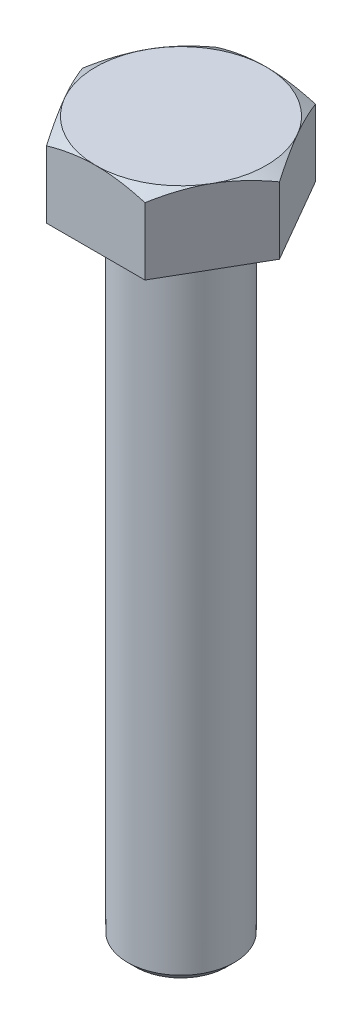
ISO-10303-21;
HEADER;
FILE_DESCRIPTION(('STEP AP214'),'2;1');
FILE_NAME('part.step','',(''),(''),'','','');
FILE_SCHEMA(('AUTOMOTIVE_DESIGN { 1 0 10303 214 1 1 1 1 }'));
ENDSEC;
DATA;
#1=APPLICATION_CONTEXT('core data for automotive mechanical design processes');
#2=APPLICATION_PROTOCOL_DEFINITION('international standard','automotive_design',2000,#1);
#3=PRODUCT_CONTEXT('',#1,'mechanical');
#4=PRODUCT('Part','Part','',(#3));
#5=PRODUCT_RELATED_PRODUCT_CATEGORY('part','',(#4));
#6=PRODUCT_DEFINITION_FORMATION('','',#4);
#7=PRODUCT_DEFINITION_CONTEXT('part definition',#1,'design');
#8=PRODUCT_DEFINITION('design','',#6,#7);
#9=PRODUCT_DEFINITION_SHAPE('','',#8);
#10=(LENGTH_UNIT() NAMED_UNIT(*) SI_UNIT(.MILLI.,.METRE.));
#11=(NAMED_UNIT(*) PLANE_ANGLE_UNIT() SI_UNIT($,.RADIAN.));
#12=(NAMED_UNIT(*) SI_UNIT($,.STERADIAN.) SOLID_ANGLE_UNIT());
#13=UNCERTAINTY_MEASURE_WITH_UNIT(LENGTH_MEASURE(1.E-05),#10,'distance_accuracy_value','');
#14=(GEOMETRIC_REPRESENTATION_CONTEXT(3) GLOBAL_UNCERTAINTY_ASSIGNED_CONTEXT((#13)) GLOBAL_UNIT_ASSIGNED_CONTEXT((#10,
#11,#12)) REPRESENTATION_CONTEXT('',''));
#15=CARTESIAN_POINT('',(0.,0.,0.));
#16=DIRECTION('',(0.,0.,1.));
#17=DIRECTION('',(1.,0.,0.));
#18=AXIS2_PLACEMENT_3D('',#15,#16,#17);
#19=CARTESIAN_POINT('',(0.,-60.,0.));
#20=DIRECTION('',(0.,1.,0.));
#21=DIRECTION('',(0.,0.,1.));
#22=AXIS2_PLACEMENT_3D('',#19,#20,#21);
#23=CYLINDRICAL_SURFACE('',#22,5.);
#24=CARTESIAN_POINT('',(0.,0.,0.));
#25=DIRECTION('',(0.,1.,0.));
#26=DIRECTION('',(0.,0.,1.));
#27=AXIS2_PLACEMENT_3D('',#24,#25,#26);
#28=CIRCLE('',#27,5.);
#29=CARTESIAN_POINT('',(0.,0.,5.));
#30=VERTEX_POINT('',#29);
#31=EDGE_CURVE('E260',#30,#30,#28,.F.);
#32=ORIENTED_EDGE('',*,*,#31,.T.);
#33=EDGE_LOOP('',(#32));
#34=FACE_BOUND('',#33,.T.);
#35=CARTESIAN_POINT('',(0.,-59.25,0.));
#36=DIRECTION('',(0.,1.,0.));
#37=DIRECTION('',(0.,0.,1.));
#38=AXIS2_PLACEMENT_3D('',#35,#36,#37);
#39=CIRCLE('',#38,5.);
#40=CARTESIAN_POINT('',(0.,-59.25,5.));
#41=VERTEX_POINT('',#40);
#42=EDGE_CURVE('E140',#41,#41,#39,.F.);
#43=ORIENTED_EDGE('',*,*,#42,.F.);
#44=EDGE_LOOP('',(#43));
#45=FACE_BOUND('',#44,.T.);
#46=ADVANCED_FACE('F47',(#34,#45),#23,.T.);
#47=CARTESIAN_POINT('',(4.61880215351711,7.,7.99999999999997));
#48=DIRECTION('',(-0.866025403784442,0.,-0.499999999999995));
#49=DIRECTION('',(-0.499999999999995,0.,0.866025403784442));
#50=AXIS2_PLACEMENT_3D('',#47,#48,#49);
#51=PLANE('',#50);
#52=CARTESIAN_POINT('',(4.61868668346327,6.28540215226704,8.00019999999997));
#53=CARTESIAN_POINT('',(4.720213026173,6.34400928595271,7.82435121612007));
#54=CARTESIAN_POINT('',(4.82211789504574,6.39995659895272,7.64784680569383));
#55=CARTESIAN_POINT('',(5.02675523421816,6.50579899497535,7.2934045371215));
#56=CARTESIAN_POINT('',(5.1294880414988,6.55569146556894,7.11546609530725));
#57=CARTESIAN_POINT('',(5.43933133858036,6.69530720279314,6.57880176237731));
#58=CARTESIAN_POINT('',(5.64766491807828,6.77471882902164,6.21795741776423));
#59=CARTESIAN_POINT('',(5.95943209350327,6.86783835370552,5.6779608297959));
#60=CARTESIAN_POINT('',(6.06193429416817,6.89436541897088,5.50042181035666));
#61=CARTESIAN_POINT('',(6.26740224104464,6.93884682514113,5.14454088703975));
#62=CARTESIAN_POINT('',(6.37036794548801,6.95680192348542,4.96619905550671));
#63=CARTESIAN_POINT('',(6.57647664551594,6.98368435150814,4.60920831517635));
#64=CARTESIAN_POINT('',(6.67961930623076,6.99262192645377,4.43055998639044));
#65=CARTESIAN_POINT('',(6.88599991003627,7.00127769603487,4.07309829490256));
#66=CARTESIAN_POINT('',(6.98923785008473,7.00099617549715,3.89428493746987));
#67=CARTESIAN_POINT('',(7.18224506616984,6.99185497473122,3.55998663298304));
#68=CARTESIAN_POINT('',(7.27202796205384,6.98411039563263,3.40447809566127));
#69=CARTESIAN_POINT('',(7.45138347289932,6.96179886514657,3.09382523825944));
#70=CARTESIAN_POINT('',(7.54095607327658,6.94723145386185,2.93868094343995));
#71=CARTESIAN_POINT('',(7.80932710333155,6.89363930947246,2.47384868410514));
#72=CARTESIAN_POINT('',(7.98765049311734,6.84473135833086,2.16498351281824));
#73=CARTESIAN_POINT('',(8.34618890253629,6.72246059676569,1.54397677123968));
#74=CARTESIAN_POINT('',(8.52635816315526,6.64857947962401,1.2319144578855));
#75=CARTESIAN_POINT('',(8.88400987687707,6.48089985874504,0.612443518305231));
#76=CARTESIAN_POINT('',(9.0614969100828,6.38714073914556,0.305026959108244));
#77=CARTESIAN_POINT('',(9.23771977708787,6.28540215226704,-0.000200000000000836));
#78=B_SPLINE_CURVE_WITH_KNOTS('',3,(#52,#53,#54,#55,#56,#57,#58,#59,#60,#61,#62,#63,#64,#65,#66,
#67,#68,#69,#70,#71,#72,#73,#74,#75,#76,#77),.UNSPECIFIED.,.F.,.F.,(4,2,2,2,2,2,2,2,2,2,2,2,4),
(0.,0.633973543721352,1.26821965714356,2.53934712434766,3.1593434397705,3.77928496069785,
4.39852133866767,5.01773858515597,5.55680239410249,6.09590254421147,7.17487077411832,
8.27776850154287,9.37850115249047),.UNSPECIFIED.);
#79=CARTESIAN_POINT('',(4.61880215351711,6.28546882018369,7.99999999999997));
#80=VERTEX_POINT('',#79);
#81=CARTESIAN_POINT('',(6.92820323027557,7.,3.99999999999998));
#82=VERTEX_POINT('',#81);
#83=EDGE_CURVE('E122',#80,#82,#78,.T.);
#84=ORIENTED_EDGE('',*,*,#83,.F.);
#85=DIRECTION('',(0.,-1.,0.));
#86=VECTOR('',#85,1.);
#87=CARTESIAN_POINT('',(4.61880215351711,7.,7.99999999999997));
#88=LINE('',#87,#86);
#89=CARTESIAN_POINT('',(4.61880215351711,0.,7.99999999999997));
#90=VERTEX_POINT('',#89);
#91=EDGE_CURVE('E71',#80,#90,#88,.T.);
#92=ORIENTED_EDGE('',*,*,#91,.T.);
#93=DIRECTION('',(0.499999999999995,0.,-0.866025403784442));
#94=VECTOR('',#93,1.);
#95=CARTESIAN_POINT('',(4.61880215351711,0.,7.99999999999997));
#96=LINE('',#95,#94);
#97=CARTESIAN_POINT('',(9.23760430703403,0.,0.));
#98=VERTEX_POINT('',#97);
#99=EDGE_CURVE('E129',#90,#98,#96,.T.);
#100=ORIENTED_EDGE('',*,*,#99,.T.);
#101=DIRECTION('',(0.,-1.,0.));
#102=VECTOR('',#101,1.);
#103=CARTESIAN_POINT('',(9.23760430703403,7.,0.));
#104=LINE('',#103,#102);
#105=CARTESIAN_POINT('',(9.23760430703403,6.28546882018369,0.));
#106=VERTEX_POINT('',#105);
#107=EDGE_CURVE('E143',#106,#98,#104,.T.);
#108=ORIENTED_EDGE('',*,*,#107,.F.);
#109=EDGE_CURVE('E130',#82,#106,#78,.T.);
#110=ORIENTED_EDGE('',*,*,#109,.F.);
#111=EDGE_LOOP('',(#84,#92,#100,#108,#110));
#112=FACE_BOUND('',#111,.T.);
#113=ADVANCED_FACE('F49',(#112),#51,.F.);
#114=CARTESIAN_POINT('',(9.23760430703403,7.,0.));
#115=DIRECTION('',(-0.866025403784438,0.,0.500000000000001));
#116=DIRECTION('',(0.500000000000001,0.,0.866025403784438));
#117=AXIS2_PLACEMENT_3D('',#114,#115,#116);
#118=PLANE('',#117);
#119=CARTESIAN_POINT('',(9.23771977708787,6.28540215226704,0.000200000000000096));
#120=CARTESIAN_POINT('',(9.13619343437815,6.34400928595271,-0.175648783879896));
#121=CARTESIAN_POINT('',(9.0342885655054,6.39995659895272,-0.352153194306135));
#122=CARTESIAN_POINT('',(8.82965122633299,6.50579899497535,-0.70659546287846));
#123=CARTESIAN_POINT('',(8.72691841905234,6.55569146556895,-0.884533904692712));
#124=CARTESIAN_POINT('',(8.41707512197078,6.69530720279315,-1.42119823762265));
#125=CARTESIAN_POINT('',(8.20874154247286,6.77471882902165,-1.78204258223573));
#126=CARTESIAN_POINT('',(7.89697436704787,6.86783835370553,-2.32203917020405));
#127=CARTESIAN_POINT('',(7.79447216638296,6.89436541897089,-2.49957818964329));
#128=CARTESIAN_POINT('',(7.58900421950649,6.93884682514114,-2.8554591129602));
#129=CARTESIAN_POINT('',(7.48603851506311,6.95680192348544,-3.03380094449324));
#130=CARTESIAN_POINT('',(7.27992981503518,6.98368435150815,-3.3907916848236));
#131=CARTESIAN_POINT('',(7.17678715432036,6.99262192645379,-3.56944001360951));
#132=CARTESIAN_POINT('',(6.97040655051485,7.00127769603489,-3.92690170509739));
#133=CARTESIAN_POINT('',(6.86716861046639,7.00099617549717,-4.10571506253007));
#134=CARTESIAN_POINT('',(6.67416139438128,6.99185497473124,-4.44001336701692));
#135=CARTESIAN_POINT('',(6.58437849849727,6.98411039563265,-4.59552190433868));
#136=CARTESIAN_POINT('',(6.40502298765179,6.96179886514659,-4.90617476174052));
#137=CARTESIAN_POINT('',(6.31545038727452,6.94723145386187,-5.06131905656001));
#138=CARTESIAN_POINT('',(6.04707935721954,6.89363930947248,-5.52615131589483));
#139=CARTESIAN_POINT('',(5.86875596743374,6.84473135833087,-5.83501648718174));
#140=CARTESIAN_POINT('',(5.51021755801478,6.72246059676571,-6.45602322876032));
#141=CARTESIAN_POINT('',(5.3300482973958,6.64857947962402,-6.7680855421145));
#142=CARTESIAN_POINT('',(4.97239658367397,6.48089985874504,-7.38755648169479));
#143=CARTESIAN_POINT('',(4.79490955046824,6.38714073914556,-7.69497304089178));
#144=CARTESIAN_POINT('',(4.61868668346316,6.28540215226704,-8.00020000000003));
#145=B_SPLINE_CURVE_WITH_KNOTS('',3,(#119,#120,#121,#122,#123,#124,#125,#126,#127,#128,#129,
#130,#131,#132,#133,#134,#135,#136,#137,#138,#139,#140,#141,#142,#143,#144),.UNSPECIFIED.,.F.,
.F.,(4,2,2,2,2,2,2,2,2,2,2,2,4),(0.,0.633973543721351,1.26821965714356,2.53934712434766,
3.1593434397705,3.77928496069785,4.39852133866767,5.01773858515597,5.5568023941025,
6.0959025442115,7.17487077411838,8.27776850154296,9.37850115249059),.UNSPECIFIED.);
#146=CARTESIAN_POINT('',(6.92820323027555,7.,-4.00000000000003));
#147=VERTEX_POINT('',#146);
#148=EDGE_CURVE('E135',#106,#147,#145,.T.);
#149=ORIENTED_EDGE('',*,*,#148,.F.);
#150=ORIENTED_EDGE('',*,*,#107,.T.);
#151=DIRECTION('',(-0.500000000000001,0.,-0.866025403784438));
#152=VECTOR('',#151,1.);
#153=CARTESIAN_POINT('',(9.23760430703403,0.,0.));
#154=LINE('',#153,#152);
#155=CARTESIAN_POINT('',(4.618802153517,0.,-8.00000000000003));
#156=VERTEX_POINT('',#155);
#157=EDGE_CURVE('E297',#98,#156,#154,.T.);
#158=ORIENTED_EDGE('',*,*,#157,.T.);
#159=DIRECTION('',(0.,-1.,0.));
#160=VECTOR('',#159,1.);
#161=CARTESIAN_POINT('',(4.618802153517,7.,-8.00000000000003));
#162=LINE('',#161,#160);
#163=CARTESIAN_POINT('',(4.618802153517,6.28546882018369,-8.00000000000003));
#164=VERTEX_POINT('',#163);
#165=EDGE_CURVE('E254',#164,#156,#162,.T.);
#166=ORIENTED_EDGE('',*,*,#165,.F.);
#167=EDGE_CURVE('E144',#147,#164,#145,.T.);
#168=ORIENTED_EDGE('',*,*,#167,.F.);
#169=EDGE_LOOP('',(#149,#150,#158,#166,#168));
#170=FACE_BOUND('',#169,.T.);
#171=ADVANCED_FACE('F203',(#170),#118,.F.);
#172=CARTESIAN_POINT('',(4.618802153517,7.,-8.00000000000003));
#173=DIRECTION('',(0.,0.,1.));
#174=DIRECTION('',(1.,0.,0.));
#175=AXIS2_PLACEMENT_3D('',#172,#173,#174);
#176=PLANE('',#175);
#177=CARTESIAN_POINT('',(-12.6403241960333,2.98210147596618,-7.99999999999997));
#178=CARTESIAN_POINT('',(-12.2888430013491,3.15352784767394,-7.99999999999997));
#179=CARTESIAN_POINT('',(-11.9365795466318,3.32337660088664,-7.99999999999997));
#180=CARTESIAN_POINT('',(-11.2300728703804,3.6590358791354,-7.99999999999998));
#181=CARTESIAN_POINT('',(-10.8758293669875,3.82484581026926,-7.99999999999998));
#182=CARTESIAN_POINT('',(-10.1632322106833,4.15232914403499,-7.99999999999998));
#183=CARTESIAN_POINT('',(-9.80486680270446,4.3139770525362,-7.99999999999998));
#184=CARTESIAN_POINT('',(-9.08536584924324,4.6309614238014,-7.99999999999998));
#185=CARTESIAN_POINT('',(-8.72423042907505,4.78629817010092,-7.99999999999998));
#186=CARTESIAN_POINT('',(-7.98618087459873,5.09418856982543,-7.99999999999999));
#187=CARTESIAN_POINT('',(-7.60915019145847,5.24646432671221,-7.99999999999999));
#188=CARTESIAN_POINT('',(-6.85076602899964,5.54004662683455,-7.99999999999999));
#189=CARTESIAN_POINT('',(-6.46941208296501,5.68135197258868,-7.99999999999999));
#190=CARTESIAN_POINT('',(-5.70241102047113,5.9494543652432,-7.99999999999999));
#191=CARTESIAN_POINT('',(-5.31677359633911,6.07627885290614,-7.99999999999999));
#192=CARTESIAN_POINT('',(-4.53998544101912,6.31150673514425,-8.));
#193=CARTESIAN_POINT('',(-4.14883641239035,6.41991568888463,-8.));
#194=CARTESIAN_POINT('',(-3.36291309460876,6.61268375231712,-8.));
#195=CARTESIAN_POINT('',(-2.96817310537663,6.6971790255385,-8.00000000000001));
#196=CARTESIAN_POINT('',(-2.37228929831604,6.80244314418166,-8.00000000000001));
#197=CARTESIAN_POINT('',(-2.17301971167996,6.8339526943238,-8.00000000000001));
#198=CARTESIAN_POINT('',(-1.7734126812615,6.88920069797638,-8.00000000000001));
#199=CARTESIAN_POINT('',(-1.57307534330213,6.9129399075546,-8.00000000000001));
#200=CARTESIAN_POINT('',(-1.17432002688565,6.95186378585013,-8.00000000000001));
#201=CARTESIAN_POINT('',(-0.975913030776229,6.96716047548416,-8.00000000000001));
#202=CARTESIAN_POINT('',(-0.578629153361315,6.98934114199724,-8.00000000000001));
#203=CARTESIAN_POINT('',(-0.379752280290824,6.99622526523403,-8.00000000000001));
#204=CARTESIAN_POINT('',(0.0181162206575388,7.00141546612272,-8.00000000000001));
#205=CARTESIAN_POINT('',(0.217107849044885,6.999721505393,-8.00000000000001));
#206=CARTESIAN_POINT('',(0.614837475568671,6.98779932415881,-8.00000000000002));
#207=CARTESIAN_POINT('',(0.813575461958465,6.97757072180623,-8.00000000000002));
#208=CARTESIAN_POINT('',(1.28422959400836,6.9434628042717,-8.00000000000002));
#209=CARTESIAN_POINT('',(1.55588667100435,6.91592258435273,-8.00000000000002));
#210=CARTESIAN_POINT('',(2.09732305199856,6.84634635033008,-8.00000000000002));
#211=CARTESIAN_POINT('',(2.36710212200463,6.80430856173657,-8.00000000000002));
#212=CARTESIAN_POINT('',(3.17322847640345,6.65866676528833,-8.00000000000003));
#213=CARTESIAN_POINT('',(3.70610589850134,6.53555570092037,-8.00000000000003));
#214=CARTESIAN_POINT('',(4.50338683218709,6.32026611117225,-8.00000000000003));
#215=CARTESIAN_POINT('',(4.77187301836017,6.24232167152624,-8.00000000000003));
#216=CARTESIAN_POINT('',(5.30624232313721,6.07788964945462,-8.00000000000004));
#217=CARTESIAN_POINT('',(5.57212542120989,5.99140199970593,-8.00000000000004));
#218=CARTESIAN_POINT('',(6.10136688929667,5.81130801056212,-8.00000000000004));
#219=CARTESIAN_POINT('',(6.3647259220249,5.71770360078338,-8.00000000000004));
#220=CARTESIAN_POINT('',(6.88922947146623,5.52452196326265,-8.00000000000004));
#221=CARTESIAN_POINT('',(7.15037404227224,5.4249448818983,-8.00000000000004));
#222=CARTESIAN_POINT('',(7.86355537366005,5.14514476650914,-8.00000000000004));
#223=CARTESIAN_POINT('',(8.31360309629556,4.95985624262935,-8.00000000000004));
#224=CARTESIAN_POINT('',(9.20895547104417,4.57811231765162,-8.00000000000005));
#225=CARTESIAN_POINT('',(9.65425955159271,4.38165558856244,-8.00000000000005));
#226=CARTESIAN_POINT('',(10.5412363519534,3.98026324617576,-8.00000000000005));
#227=CARTESIAN_POINT('',(10.9829075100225,3.77532419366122,-8.00000000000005));
#228=CARTESIAN_POINT('',(11.8631821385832,3.35903186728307,-8.00000000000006));
#229=CARTESIAN_POINT('',(12.3017857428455,3.14767887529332,-8.00000000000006));
#230=CARTESIAN_POINT('',(13.1772814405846,2.71961681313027,-8.00000000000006));
#231=CARTESIAN_POINT('',(13.6141694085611,2.50289932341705,-8.00000000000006));
#232=CARTESIAN_POINT('',(14.4859595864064,2.06550352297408,-8.00000000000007));
#233=CARTESIAN_POINT('',(14.9208617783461,1.84482517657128,-8.00000000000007));
#234=CARTESIAN_POINT('',(15.7889376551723,1.40034905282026,-8.00000000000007));
#235=CARTESIAN_POINT('',(16.2221117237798,1.17655202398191,-8.00000000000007));
#236=CARTESIAN_POINT('',(17.0871185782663,0.726379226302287,-8.00000000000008));
#237=CARTESIAN_POINT('',(17.5189513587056,0.500003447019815,-8.00000000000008));
#238=CARTESIAN_POINT('',(18.71912958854,-0.132898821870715,-8.00000000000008));
#239=CARTESIAN_POINT('',(19.4862640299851,-0.541721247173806,-8.00000000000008));
#240=CARTESIAN_POINT('',(21.0179839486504,-1.36422301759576,-8.00000000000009));
#241=CARTESIAN_POINT('',(21.782569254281,-1.7779026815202,-8.00000000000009));
#242=CARTESIAN_POINT('',(23.3071112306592,-2.60742602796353,-8.0000000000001));
#243=CARTESIAN_POINT('',(24.0670747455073,-3.0232571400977,-8.0000000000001));
#244=CARTESIAN_POINT('',(25.2058550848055,-3.64904710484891,-8.00000000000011));
#245=CARTESIAN_POINT('',(25.5852388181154,-3.85797568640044,-8.00000000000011));
#246=CARTESIAN_POINT('',(26.34366906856,-4.27644296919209,-8.00000000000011));
#247=CARTESIAN_POINT('',(26.7227155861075,-4.48598166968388,-8.00000000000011));
#248=CARTESIAN_POINT('',(27.1016142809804,-4.69578739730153,-8.00000000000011));
#249=B_SPLINE_CURVE_WITH_KNOTS('',3,(#177,#178,#179,#180,#181,#182,#183,#184,#185,#186,#187,
#188,#189,#190,#191,#192,#193,#194,#195,#196,#197,#198,#199,#200,#201,#202,#203,#204,#205,#206,
#207,#208,#209,#210,#211,#212,#213,#214,#215,#216,#217,#218,#219,#220,#221,#222,#223,#224,#225,
#226,#227,#228,#229,#230,#231,#232,#233,#234,#235,#236,#237,#238,#239,#240,#241,#242,#243,#244,
#245,#246,#247,#248),.UNSPECIFIED.,.F.,.F.,(4,2,2,2,2,2,2,2,2,2,2,2,2,2,2,2,2,2,2,2,2,2,2,2,2,2,
2,2,2,2,2,2,2,2,2,4),(0.,1.17318598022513,2.3465434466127,3.52590216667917,4.70520784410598,
5.92493599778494,7.14479710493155,8.36230684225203,9.57944838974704,10.7895133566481,
11.3946221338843,11.9996720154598,12.5964878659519,13.1932933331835,13.7901014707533,
14.3869363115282,15.2056272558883,16.0244184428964,17.6627769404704,18.5014144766,
19.3400586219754,20.1784761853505,21.0168732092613,22.4767387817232,23.936778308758,
25.3974157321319,26.857989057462,28.321021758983,29.7840676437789,31.2467682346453,
32.7094747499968,35.3172586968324,37.9252147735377,40.5240797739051,41.8234055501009,
43.122729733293),.UNSPECIFIED.);
#250=CARTESIAN_POINT('',(0.,7.,-8.00000000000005));
#251=VERTEX_POINT('',#250);
#252=EDGE_CURVE('E197',#164,#251,#249,.F.);
#253=ORIENTED_EDGE('',*,*,#252,.F.);
#254=ORIENTED_EDGE('',*,*,#165,.T.);
#255=DIRECTION('',(-1.,0.,0.));
#256=VECTOR('',#255,1.);
#257=CARTESIAN_POINT('',(4.618802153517,0.,-8.00000000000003));
#258=LINE('',#257,#256);
#259=CARTESIAN_POINT('',(-4.61880215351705,0.,-8.));
#260=VERTEX_POINT('',#259);
#261=EDGE_CURVE('E296',#156,#260,#258,.T.);
#262=ORIENTED_EDGE('',*,*,#261,.T.);
#263=DIRECTION('',(0.,-1.,0.));
#264=VECTOR('',#263,1.);
#265=CARTESIAN_POINT('',(-4.61880215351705,7.,-8.));
#266=LINE('',#265,#264);
#267=CARTESIAN_POINT('',(-4.61880215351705,6.28546882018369,-8.));
#268=VERTEX_POINT('',#267);
#269=EDGE_CURVE('E251',#268,#260,#266,.T.);
#270=ORIENTED_EDGE('',*,*,#269,.F.);
#271=EDGE_CURVE('E191',#251,#268,#249,.F.);
#272=ORIENTED_EDGE('',*,*,#271,.F.);
#273=EDGE_LOOP('',(#253,#254,#262,#270,#272));
#274=FACE_BOUND('',#273,.T.);
#275=ADVANCED_FACE('F199',(#274),#176,.F.);
#276=CARTESIAN_POINT('',(-4.61880215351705,7.,-8.));
#277=DIRECTION('',(0.866025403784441,0.,0.499999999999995));
#278=DIRECTION('',(0.499999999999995,0.,-0.866025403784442));
#279=AXIS2_PLACEMENT_3D('',#276,#277,#278);
#280=PLANE('',#279);
#281=CARTESIAN_POINT('',(-4.61868668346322,6.28540215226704,-8.0002));
#282=CARTESIAN_POINT('',(-4.72021302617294,6.34400928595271,-7.8243512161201));
#283=CARTESIAN_POINT('',(-4.82211789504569,6.39995659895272,-7.64784680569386));
#284=CARTESIAN_POINT('',(-5.0267552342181,6.50579899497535,-7.29340453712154));
#285=CARTESIAN_POINT('',(-5.12948804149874,6.55569146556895,-7.11546609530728));
#286=CARTESIAN_POINT('',(-5.4393313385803,6.69530720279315,-6.57880176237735));
#287=CARTESIAN_POINT('',(-5.64766491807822,6.77471882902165,-6.21795741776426));
#288=CARTESIAN_POINT('',(-5.95943209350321,6.86783835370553,-5.67796082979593));
#289=CARTESIAN_POINT('',(-6.06193429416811,6.89436541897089,-5.5004218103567));
#290=CARTESIAN_POINT('',(-6.26740224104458,6.93884682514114,-5.14454088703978));
#291=CARTESIAN_POINT('',(-6.37036794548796,6.95680192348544,-4.96619905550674));
#292=CARTESIAN_POINT('',(-6.57647664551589,6.98368435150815,-4.60920831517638));
#293=CARTESIAN_POINT('',(-6.67961930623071,6.99262192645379,-4.43055998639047));
#294=CARTESIAN_POINT('',(-6.88599991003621,7.00127769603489,-4.07309829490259));
#295=CARTESIAN_POINT('',(-6.98923785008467,7.00099617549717,-3.89428493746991));
#296=CARTESIAN_POINT('',(-7.18224506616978,6.99185497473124,-3.55998663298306));
#297=CARTESIAN_POINT('',(-7.27202796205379,6.98411039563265,-3.4044780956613));
#298=CARTESIAN_POINT('',(-7.45138347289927,6.96179886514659,-3.09382523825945));
#299=CARTESIAN_POINT('',(-7.54095607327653,6.94723145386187,-2.93868094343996));
#300=CARTESIAN_POINT('',(-7.80932710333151,6.89363930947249,-2.47384868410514));
#301=CARTESIAN_POINT('',(-7.9876504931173,6.84473135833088,-2.16498351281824));
#302=CARTESIAN_POINT('',(-8.34618890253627,6.72246059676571,-1.54397677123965));
#303=CARTESIAN_POINT('',(-8.52635816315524,6.64857947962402,-1.23191445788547));
#304=CARTESIAN_POINT('',(-8.88400987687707,6.48089985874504,-0.612443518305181));
#305=CARTESIAN_POINT('',(-9.0614969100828,6.38714073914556,-0.305026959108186));
#306=CARTESIAN_POINT('',(-9.23771977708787,6.28540215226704,0.000200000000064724));
#307=B_SPLINE_CURVE_WITH_KNOTS('',3,(#281,#282,#283,#284,#285,#286,#287,#288,#289,#290,#291,
#292,#293,#294,#295,#296,#297,#298,#299,#300,#301,#302,#303,#304,#305,#306),.UNSPECIFIED.,.F.,
.F.,(4,2,2,2,2,2,2,2,2,2,2,2,4),(0.,0.633973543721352,1.26821965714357,2.53934712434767,
3.1593434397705,3.77928496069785,4.39852133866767,5.01773858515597,5.55680239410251,
6.0959025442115,7.17487077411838,8.27776850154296,9.37850115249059),.UNSPECIFIED.);
#308=CARTESIAN_POINT('',(-6.92820323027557,7.,-3.99999999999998));
#309=VERTEX_POINT('',#308);
#310=EDGE_CURVE('E198',#268,#309,#307,.T.);
#311=ORIENTED_EDGE('',*,*,#310,.F.);
#312=ORIENTED_EDGE('',*,*,#269,.T.);
#313=DIRECTION('',(-0.499999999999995,0.,0.866025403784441));
#314=VECTOR('',#313,1.);
#315=CARTESIAN_POINT('',(-4.61880215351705,0.,-8.));
#316=LINE('',#315,#314);
#317=CARTESIAN_POINT('',(-9.23760430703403,0.,0.));
#318=VERTEX_POINT('',#317);
#319=EDGE_CURVE('E249',#260,#318,#316,.T.);
#320=ORIENTED_EDGE('',*,*,#319,.T.);
#321=DIRECTION('',(0.,-1.,0.));
#322=VECTOR('',#321,1.);
#323=CARTESIAN_POINT('',(-9.23760430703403,7.,0.));
#324=LINE('',#323,#322);
#325=CARTESIAN_POINT('',(-9.23760430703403,6.28546882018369,0.));
#326=VERTEX_POINT('',#325);
#327=EDGE_CURVE('E241',#326,#318,#324,.T.);
#328=ORIENTED_EDGE('',*,*,#327,.F.);
#329=EDGE_CURVE('E185',#309,#326,#307,.T.);
#330=ORIENTED_EDGE('',*,*,#329,.F.);
#331=EDGE_LOOP('',(#311,#312,#320,#328,#330));
#332=FACE_BOUND('',#331,.T.);
#333=ADVANCED_FACE('F202',(#332),#280,.F.);
#334=CARTESIAN_POINT('',(-9.23760430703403,7.,0.));
#335=DIRECTION('',(0.866025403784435,0.,-0.500000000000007));
#336=DIRECTION('',(-0.500000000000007,0.,-0.866025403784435));
#337=AXIS2_PLACEMENT_3D('',#334,#335,#336);
#338=PLANE('',#337);
#339=CARTESIAN_POINT('',(-9.23771977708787,6.28540215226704,-0.000199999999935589));
#340=CARTESIAN_POINT('',(-9.13619343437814,6.34400928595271,0.175648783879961));
#341=CARTESIAN_POINT('',(-9.0342885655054,6.39995659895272,0.352153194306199));
#342=CARTESIAN_POINT('',(-8.82965122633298,6.50579899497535,0.706595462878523));
#343=CARTESIAN_POINT('',(-8.72691841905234,6.55569146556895,0.884533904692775));
#344=CARTESIAN_POINT('',(-8.41707512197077,6.69530720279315,1.42119823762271));
#345=CARTESIAN_POINT('',(-8.20874154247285,6.77471882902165,1.78204258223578));
#346=CARTESIAN_POINT('',(-7.89697436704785,6.86783835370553,2.32203917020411));
#347=CARTESIAN_POINT('',(-7.79447216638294,6.89436541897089,2.49957818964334));
#348=CARTESIAN_POINT('',(-7.58900421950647,6.93884682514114,2.85545911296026));
#349=CARTESIAN_POINT('',(-7.48603851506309,6.95680192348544,3.0338009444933));
#350=CARTESIAN_POINT('',(-7.27992981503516,6.98368435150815,3.39079168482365));
#351=CARTESIAN_POINT('',(-7.17678715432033,6.99262192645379,3.56944001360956));
#352=CARTESIAN_POINT('',(-6.97040655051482,7.00127769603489,3.92690170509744));
#353=CARTESIAN_POINT('',(-6.86716861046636,7.00099617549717,4.10571506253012));
#354=CARTESIAN_POINT('',(-6.67416139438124,6.99185497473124,4.44001336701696));
#355=CARTESIAN_POINT('',(-6.58437849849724,6.98411039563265,4.59552190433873));
#356=CARTESIAN_POINT('',(-6.40502298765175,6.96179886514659,4.90617476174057));
#357=CARTESIAN_POINT('',(-6.31545038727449,6.94723145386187,5.06131905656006));
#358=CARTESIAN_POINT('',(-6.0470793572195,6.89363930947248,5.52615131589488));
#359=CARTESIAN_POINT('',(-5.86875596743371,6.84473135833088,5.83501648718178));
#360=CARTESIAN_POINT('',(-5.51021755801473,6.72246059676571,6.45602322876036));
#361=CARTESIAN_POINT('',(-5.33004829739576,6.64857947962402,6.76808554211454));
#362=CARTESIAN_POINT('',(-4.97239658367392,6.48089985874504,7.38755648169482));
#363=CARTESIAN_POINT('',(-4.79490955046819,6.38714073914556,7.69497304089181));
#364=CARTESIAN_POINT('',(-4.61868668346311,6.28540215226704,8.00020000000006));
#365=B_SPLINE_CURVE_WITH_KNOTS('',3,(#339,#340,#341,#342,#343,#344,#345,#346,#347,#348,#349,
#350,#351,#352,#353,#354,#355,#356,#357,#358,#359,#360,#361,#362,#363,#364),.UNSPECIFIED.,.F.,
.F.,(4,2,2,2,2,2,2,2,2,2,2,2,4),(0.,0.633973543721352,1.26821965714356,2.53934712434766,
3.1593434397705,3.77928496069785,4.39852133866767,5.01773858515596,5.5568023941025,
6.0959025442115,7.17487077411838,8.27776850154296,9.37850115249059),.UNSPECIFIED.);
#366=CARTESIAN_POINT('',(-6.92820323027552,7.,4.00000000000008));
#367=VERTEX_POINT('',#366);
#368=EDGE_CURVE('E238',#326,#367,#365,.T.);
#369=ORIENTED_EDGE('',*,*,#368,.F.);
#370=ORIENTED_EDGE('',*,*,#327,.T.);
#371=DIRECTION('',(0.500000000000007,0.,0.866025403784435));
#372=VECTOR('',#371,1.);
#373=CARTESIAN_POINT('',(-9.23760430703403,0.,0.));
#374=LINE('',#373,#372);
#375=CARTESIAN_POINT('',(-4.61880215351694,0.,8.00000000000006));
#376=VERTEX_POINT('',#375);
#377=EDGE_CURVE('E286',#318,#376,#374,.T.);
#378=ORIENTED_EDGE('',*,*,#377,.T.);
#379=DIRECTION('',(0.,-1.,0.));
#380=VECTOR('',#379,1.);
#381=CARTESIAN_POINT('',(-4.61880215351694,7.,8.00000000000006));
#382=LINE('',#381,#380);
#383=CARTESIAN_POINT('',(-4.61880215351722,6.28546882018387,8.00000000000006));
#384=VERTEX_POINT('',#383);
#385=EDGE_CURVE('E252',#384,#376,#382,.T.);
#386=ORIENTED_EDGE('',*,*,#385,.F.);
#387=EDGE_CURVE('E177',#367,#384,#365,.T.);
#388=ORIENTED_EDGE('',*,*,#387,.F.);
#389=EDGE_LOOP('',(#369,#370,#378,#386,#388));
#390=FACE_BOUND('',#389,.T.);
#391=ADVANCED_FACE('F227',(#390),#338,.F.);
#392=CARTESIAN_POINT('',(-4.61880215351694,7.,8.00000000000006));
#393=DIRECTION('',(0.,0.,-1.));
#394=DIRECTION('',(-1.,0.,0.));
#395=AXIS2_PLACEMENT_3D('',#392,#393,#394);
#396=PLANE('',#395);
#397=CARTESIAN_POINT('',(-12.6403241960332,2.98210147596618,8.00000000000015));
#398=CARTESIAN_POINT('',(-12.288843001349,3.15352784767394,8.00000000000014));
#399=CARTESIAN_POINT('',(-11.9365795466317,3.32337660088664,8.00000000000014));
#400=CARTESIAN_POINT('',(-11.2300728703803,3.6590358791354,8.00000000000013));
#401=CARTESIAN_POINT('',(-10.8758293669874,3.82484581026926,8.00000000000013));
#402=CARTESIAN_POINT('',(-10.1632322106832,4.15232914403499,8.00000000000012));
#403=CARTESIAN_POINT('',(-9.80486680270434,4.3139770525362,8.00000000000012));
#404=CARTESIAN_POINT('',(-9.08536584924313,4.6309614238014,8.00000000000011));
#405=CARTESIAN_POINT('',(-8.72423042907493,4.78629817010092,8.00000000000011));
#406=CARTESIAN_POINT('',(-7.98618087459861,5.09418856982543,8.0000000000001));
#407=CARTESIAN_POINT('',(-7.60915019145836,5.24646432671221,8.00000000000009));
#408=CARTESIAN_POINT('',(-6.85076602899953,5.54004662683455,8.00000000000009));
#409=CARTESIAN_POINT('',(-6.4694120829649,5.68135197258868,8.00000000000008));
#410=CARTESIAN_POINT('',(-5.70241102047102,5.9494543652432,8.00000000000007));
#411=CARTESIAN_POINT('',(-5.31677359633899,6.07627885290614,8.00000000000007));
#412=CARTESIAN_POINT('',(-4.539985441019,6.31150673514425,8.00000000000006));
#413=CARTESIAN_POINT('',(-4.14883641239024,6.41991568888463,8.00000000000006));
#414=CARTESIAN_POINT('',(-3.36291309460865,6.61268375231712,8.00000000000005));
#415=CARTESIAN_POINT('',(-2.96817310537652,6.6971790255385,8.00000000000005));
#416=CARTESIAN_POINT('',(-2.37228929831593,6.80244314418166,8.00000000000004));
#417=CARTESIAN_POINT('',(-2.17301971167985,6.8339526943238,8.00000000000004));
#418=CARTESIAN_POINT('',(-1.77341268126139,6.88920069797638,8.00000000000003));
#419=CARTESIAN_POINT('',(-1.57307534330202,6.9129399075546,8.00000000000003));
#420=CARTESIAN_POINT('',(-1.17432002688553,6.95186378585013,8.00000000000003));
#421=CARTESIAN_POINT('',(-0.975913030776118,6.96716047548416,8.00000000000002));
#422=CARTESIAN_POINT('',(-0.578629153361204,6.98934114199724,8.00000000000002));
#423=CARTESIAN_POINT('',(-0.379752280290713,6.99622526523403,8.00000000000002));
#424=CARTESIAN_POINT('',(0.0181162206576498,7.00141546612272,8.00000000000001));
#425=CARTESIAN_POINT('',(0.217107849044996,6.999721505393,8.00000000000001));
#426=CARTESIAN_POINT('',(0.614837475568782,6.98779932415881,8.00000000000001));
#427=CARTESIAN_POINT('',(0.813575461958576,6.97757072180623,8.00000000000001));
#428=CARTESIAN_POINT('',(1.28422959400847,6.9434628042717,8.));
#429=CARTESIAN_POINT('',(1.55588667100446,6.91592258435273,8.));
#430=CARTESIAN_POINT('',(2.09732305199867,6.84634635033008,7.99999999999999));
#431=CARTESIAN_POINT('',(2.36710212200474,6.80430856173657,7.99999999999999));
#432=CARTESIAN_POINT('',(3.17322847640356,6.65866676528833,7.99999999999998));
#433=CARTESIAN_POINT('',(3.70610589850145,6.53555570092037,7.99999999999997));
#434=CARTESIAN_POINT('',(4.5033868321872,6.32026611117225,7.99999999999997));
#435=CARTESIAN_POINT('',(4.77187301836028,6.24232167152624,7.99999999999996));
#436=CARTESIAN_POINT('',(5.30624232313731,6.07788964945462,7.99999999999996));
#437=CARTESIAN_POINT('',(5.57212542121,5.99140199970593,7.99999999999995));
#438=CARTESIAN_POINT('',(6.10136688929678,5.81130801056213,7.99999999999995));
#439=CARTESIAN_POINT('',(6.36472592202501,5.71770360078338,7.99999999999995));
#440=CARTESIAN_POINT('',(6.88922947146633,5.52452196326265,7.99999999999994));
#441=CARTESIAN_POINT('',(7.15037404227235,5.4249448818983,7.99999999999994));
#442=CARTESIAN_POINT('',(7.86355537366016,5.14514476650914,7.99999999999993));
#443=CARTESIAN_POINT('',(8.31360309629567,4.95985624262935,7.99999999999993));
#444=CARTESIAN_POINT('',(9.20895547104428,4.57811231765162,7.99999999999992));
#445=CARTESIAN_POINT('',(9.65425955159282,4.38165558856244,7.99999999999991));
#446=CARTESIAN_POINT('',(10.5412363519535,3.98026324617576,7.9999999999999));
#447=CARTESIAN_POINT('',(10.9829075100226,3.77532419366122,7.9999999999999));
#448=CARTESIAN_POINT('',(11.8631821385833,3.35903186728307,7.99999999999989));
#449=CARTESIAN_POINT('',(12.3017857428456,3.14767887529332,7.99999999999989));
#450=CARTESIAN_POINT('',(13.1772814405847,2.71961681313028,7.99999999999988));
#451=CARTESIAN_POINT('',(13.6141694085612,2.50289932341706,7.99999999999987));
#452=CARTESIAN_POINT('',(14.4859595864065,2.06550352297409,7.99999999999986));
#453=CARTESIAN_POINT('',(14.9208617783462,1.84482517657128,7.99999999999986));
#454=CARTESIAN_POINT('',(15.7889376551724,1.40034905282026,7.99999999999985));
#455=CARTESIAN_POINT('',(16.2221117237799,1.17655202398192,7.99999999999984));
#456=CARTESIAN_POINT('',(17.0871185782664,0.726379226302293,7.99999999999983));
#457=CARTESIAN_POINT('',(17.5189513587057,0.50000344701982,7.99999999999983));
#458=CARTESIAN_POINT('',(18.7191295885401,-0.132898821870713,7.99999999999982));
#459=CARTESIAN_POINT('',(19.4862640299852,-0.541721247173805,7.99999999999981));
#460=CARTESIAN_POINT('',(21.0179839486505,-1.36422301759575,7.99999999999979));
#461=CARTESIAN_POINT('',(21.7825692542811,-1.77790268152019,7.99999999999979));
#462=CARTESIAN_POINT('',(23.3071112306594,-2.60742602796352,7.99999999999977));
#463=CARTESIAN_POINT('',(24.0670747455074,-3.02325714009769,7.99999999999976));
#464=CARTESIAN_POINT('',(25.2058550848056,-3.6490471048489,7.99999999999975));
#465=CARTESIAN_POINT('',(25.5852388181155,-3.85797568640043,7.99999999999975));
#466=CARTESIAN_POINT('',(26.3436690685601,-4.27644296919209,7.99999999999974));
#467=CARTESIAN_POINT('',(26.7227155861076,-4.48598166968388,7.99999999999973));
#468=CARTESIAN_POINT('',(27.1016142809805,-4.69578739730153,7.99999999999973));
#469=B_SPLINE_CURVE_WITH_KNOTS('',3,(#397,#398,#399,#400,#401,#402,#403,#404,#405,#406,#407,
#408,#409,#410,#411,#412,#413,#414,#415,#416,#417,#418,#419,#420,#421,#422,#423,#424,#425,#426,
#427,#428,#429,#430,#431,#432,#433,#434,#435,#436,#437,#438,#439,#440,#441,#442,#443,#444,#445,
#446,#447,#448,#449,#450,#451,#452,#453,#454,#455,#456,#457,#458,#459,#460,#461,#462,#463,#464,
#465,#466,#467,#468),.UNSPECIFIED.,.F.,.F.,(4,2,2,2,2,2,2,2,2,2,2,2,2,2,2,2,2,2,2,2,2,2,2,2,2,2,
2,2,2,2,2,2,2,2,2,4),(0.,1.17318598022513,2.3465434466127,3.52590216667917,4.70520784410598,
5.92493599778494,7.14479710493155,8.36230684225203,9.57944838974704,10.7895133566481,
11.3946221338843,11.9996720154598,12.5964878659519,13.1932933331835,13.7901014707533,
14.3869363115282,15.2056272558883,16.0244184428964,17.6627769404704,18.5014144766,
19.3400586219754,20.1784761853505,21.0168732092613,22.4767387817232,23.936778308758,
25.3974157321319,26.857989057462,28.3210217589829,29.7840676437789,31.2467682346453,
32.7094747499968,35.3172586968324,37.9252147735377,40.5240797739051,41.8234055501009,
43.122729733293),.UNSPECIFIED.);
#470=CARTESIAN_POINT('',(0.,7.,8.00000000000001));
#471=VERTEX_POINT('',#470);
#472=EDGE_CURVE('E285',#384,#471,#469,.T.);
#473=ORIENTED_EDGE('',*,*,#472,.F.);
#474=ORIENTED_EDGE('',*,*,#385,.T.);
#475=DIRECTION('',(1.,0.,0.));
#476=VECTOR('',#475,1.);
#477=CARTESIAN_POINT('',(-4.61880215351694,0.,8.00000000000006));
#478=LINE('',#477,#476);
#479=EDGE_CURVE('E289',#376,#90,#478,.T.);
#480=ORIENTED_EDGE('',*,*,#479,.T.);
#481=ORIENTED_EDGE('',*,*,#91,.F.);
#482=EDGE_CURVE('E127',#471,#80,#469,.T.);
#483=ORIENTED_EDGE('',*,*,#482,.F.);
#484=EDGE_LOOP('',(#473,#474,#480,#481,#483));
#485=FACE_BOUND('',#484,.T.);
#486=ADVANCED_FACE('F223',(#485),#396,.F.);
#487=CARTESIAN_POINT('',(0.,0.,0.));
#488=DIRECTION('',(0.,1.,0.));
#489=DIRECTION('',(0.,0.,1.));
#490=AXIS2_PLACEMENT_3D('',#487,#488,#489);
#491=PLANE('',#490);
#492=ORIENTED_EDGE('',*,*,#31,.F.);
#493=EDGE_LOOP('',(#492));
#494=FACE_BOUND('',#493,.T.);
#495=ORIENTED_EDGE('',*,*,#99,.F.);
#496=ORIENTED_EDGE('',*,*,#479,.F.);
#497=ORIENTED_EDGE('',*,*,#377,.F.);
#498=ORIENTED_EDGE('',*,*,#319,.F.);
#499=ORIENTED_EDGE('',*,*,#261,.F.);
#500=ORIENTED_EDGE('',*,*,#157,.F.);
#501=EDGE_LOOP('',(#495,#496,#497,#498,#499,#500));
#502=FACE_BOUND('',#501,.T.);
#503=ADVANCED_FACE('F221',(#494,#502),#491,.F.);
#504=CARTESIAN_POINT('',(0.,7.,0.));
#505=DIRECTION('',(0.,-1.,0.));
#506=DIRECTION('',(0.,0.,1.));
#507=AXIS2_PLACEMENT_3D('',#504,#505,#506);
#508=CONICAL_SURFACE('',#507,8.00000000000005,1.0471975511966);
#509=ORIENTED_EDGE('',*,*,#387,.T.);
#510=ORIENTED_EDGE('',*,*,#472,.T.);
#511=CARTESIAN_POINT('',(0.,7.,0.));
#512=DIRECTION('',(0.,1.,0.));
#513=DIRECTION('',(0.,0.,1.));
#514=AXIS2_PLACEMENT_3D('',#511,#512,#513);
#515=CIRCLE('',#514,8.00000000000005);
#516=EDGE_CURVE('E52',#367,#471,#515,.T.);
#517=ORIENTED_EDGE('',*,*,#516,.F.);
#518=EDGE_LOOP('',(#509,#510,#517));
#519=FACE_BOUND('',#518,.T.);
#520=ADVANCED_FACE('F162',(#519),#508,.T.);
#521=ORIENTED_EDGE('',*,*,#329,.T.);
#522=ORIENTED_EDGE('',*,*,#368,.T.);
#523=EDGE_CURVE('E262',#309,#367,#515,.T.);
#524=ORIENTED_EDGE('',*,*,#523,.F.);
#525=EDGE_LOOP('',(#521,#522,#524));
#526=FACE_BOUND('',#525,.T.);
#527=ADVANCED_FACE('F274',(#526),#508,.T.);
#528=ORIENTED_EDGE('',*,*,#271,.T.);
#529=ORIENTED_EDGE('',*,*,#310,.T.);
#530=EDGE_CURVE('E263',#251,#309,#515,.T.);
#531=ORIENTED_EDGE('',*,*,#530,.F.);
#532=EDGE_LOOP('',(#528,#529,#531));
#533=FACE_BOUND('',#532,.T.);
#534=ADVANCED_FACE('F273',(#533),#508,.T.);
#535=ORIENTED_EDGE('',*,*,#167,.T.);
#536=ORIENTED_EDGE('',*,*,#252,.T.);
#537=EDGE_CURVE('E57',#147,#251,#515,.T.);
#538=ORIENTED_EDGE('',*,*,#537,.F.);
#539=EDGE_LOOP('',(#535,#536,#538));
#540=FACE_BOUND('',#539,.T.);
#541=ADVANCED_FACE('F280',(#540),#508,.T.);
#542=ORIENTED_EDGE('',*,*,#109,.T.);
#543=ORIENTED_EDGE('',*,*,#148,.T.);
#544=EDGE_CURVE('E12',#82,#147,#515,.T.);
#545=ORIENTED_EDGE('',*,*,#544,.F.);
#546=EDGE_LOOP('',(#542,#543,#545));
#547=FACE_BOUND('',#546,.T.);
#548=ADVANCED_FACE('F133',(#547),#508,.T.);
#549=ORIENTED_EDGE('',*,*,#83,.T.);
#550=CARTESIAN_POINT('',(0.,7.,0.));
#551=DIRECTION('',(0.,1.,0.));
#552=DIRECTION('',(0.,0.,1.));
#553=AXIS2_PLACEMENT_3D('',#550,#551,#552);
#554=CIRCLE('',#553,8.00000000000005);
#555=EDGE_CURVE('E125',#471,#82,#554,.T.);
#556=ORIENTED_EDGE('',*,*,#555,.F.);
#557=ORIENTED_EDGE('',*,*,#482,.T.);
#558=EDGE_LOOP('',(#549,#556,#557));
#559=FACE_BOUND('',#558,.T.);
#560=ADVANCED_FACE('F124',(#559),#508,.T.);
#561=CARTESIAN_POINT('',(0.,7.,0.));
#562=DIRECTION('',(0.,1.,0.));
#563=DIRECTION('',(0.,0.,1.));
#564=AXIS2_PLACEMENT_3D('',#561,#562,#563);
#565=PLANE('',#564);
#566=ORIENTED_EDGE('',*,*,#516,.T.);
#567=ORIENTED_EDGE('',*,*,#555,.T.);
#568=ORIENTED_EDGE('',*,*,#544,.T.);
#569=ORIENTED_EDGE('',*,*,#537,.T.);
#570=ORIENTED_EDGE('',*,*,#530,.T.);
#571=ORIENTED_EDGE('',*,*,#523,.T.);
#572=EDGE_LOOP('',(#566,#567,#568,#569,#570,#571));
#573=FACE_BOUND('',#572,.T.);
#574=ADVANCED_FACE('F139',(#573),#565,.T.);
#575=CARTESIAN_POINT('',(0.,-60.,0.));
#576=DIRECTION('',(0.,1.,0.));
#577=DIRECTION('',(0.,0.,-1.));
#578=AXIS2_PLACEMENT_3D('',#575,#576,#577);
#579=CONICAL_SURFACE('',#578,4.25,0.78539816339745);
#580=CARTESIAN_POINT('',(0.,-60.,0.));
#581=DIRECTION('',(0.,-1.,0.));
#582=DIRECTION('',(0.,0.,-1.));
#583=AXIS2_PLACEMENT_3D('',#580,#581,#582);
#584=CIRCLE('',#583,4.25);
#585=CARTESIAN_POINT('',(0.,-60.,-4.25));
#586=VERTEX_POINT('',#585);
#587=EDGE_CURVE('E340',#586,#586,#584,.T.);
#588=ORIENTED_EDGE('',*,*,#587,.F.);
#589=EDGE_LOOP('',(#588));
#590=FACE_BOUND('',#589,.T.);
#591=ORIENTED_EDGE('',*,*,#42,.T.);
#592=EDGE_LOOP('',(#591));
#593=FACE_BOUND('',#592,.T.);
#594=ADVANCED_FACE('F163',(#590,#593),#579,.T.);
#595=CARTESIAN_POINT('',(0.,-60.,0.));
#596=DIRECTION('',(0.,-1.,0.));
#597=DIRECTION('',(0.,0.,-1.));
#598=AXIS2_PLACEMENT_3D('',#595,#596,#597);
#599=PLANE('',#598);
#600=ORIENTED_EDGE('',*,*,#587,.T.);
#601=EDGE_LOOP('',(#600));
#602=FACE_BOUND('',#601,.T.);
#603=ADVANCED_FACE('F164',(#602),#599,.T.);
#604=CLOSED_SHELL('',(#46,#113,#171,#275,#333,#391,#486,#503,#520,#527,#534,#541,#548,#560,#574,
#594,#603));
#605=MANIFOLD_SOLID_BREP('B2',#604);
#606=ADVANCED_BREP_SHAPE_REPRESENTATION('',(#18,#605),#14);
#607=SHAPE_DEFINITION_REPRESENTATION(#9,#606);
ENDSEC;
END-ISO-10303-21;
